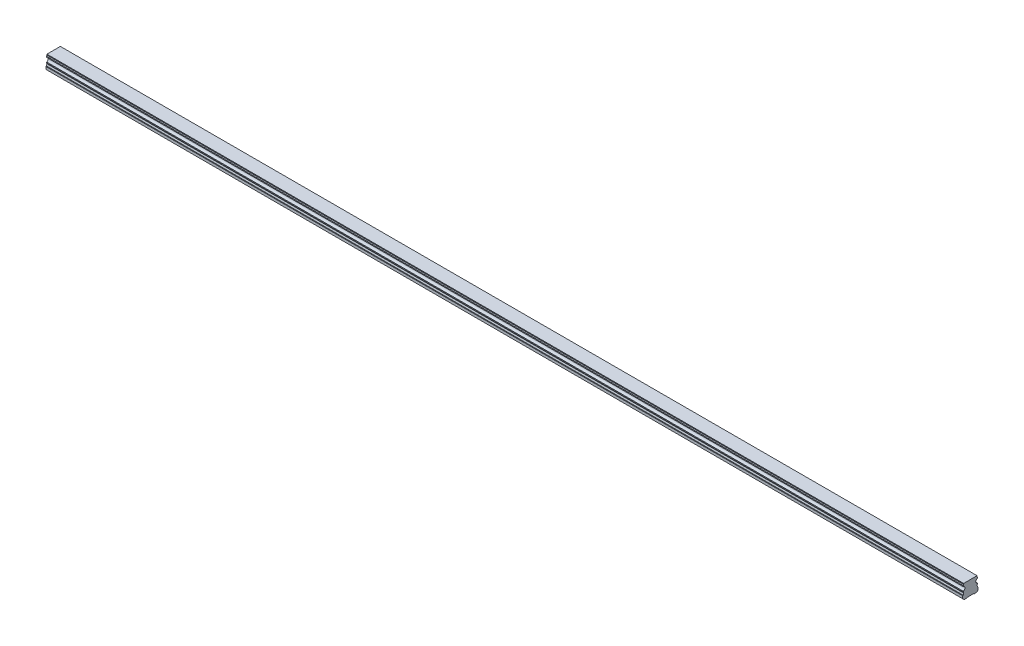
from build123d import *

# Parameters (mm, degrees)
BOSS_EXTRUDE1_DEPTH        = 900
SKETCH3_R                  = 2.5
SKETCH3_R_2                = 2.1
CUT_EXTRUDE3_DEPTH         = 7
SKETCH3_2_R                = 2.1
CUT_EXTRUDE4_DEPTH         = 9.5
CHAMFER1_SIZE              = 0.4
LPATTERN2_COUNT            = 15
LPATTERN2_PITCH            = 60
CHAMFER1_OF_LPATTERN2_SIZE = 0.4


with BuildPart() as part:
    # Sketch1 → Boss-Extrude1 (new body)
    with BuildSketch(Plane(origin=(0, 0, 0), x_dir=(0, 0, -1), z_dir=(1, 0, 0))):
        with BuildLine():
            Line((6.59, 14), (-6.59, 14))
            Line((-6.59, 14), (-6.59, 13.15))
            Line((-6.59, 13.15), (-6.96, 12.356532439))
            Line((-6.96, 12.356532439), (-6.96, 11.435174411))
            ThreePointArc((-6.96, 11.435174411), (-5.25, 9.5), (-6.96, 7.564825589))
            Line((-6.96, 7.564825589), (-6.96, 6.643467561))
            Line((-6.96, 6.643467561), (-6.59, 5.85))
            Line((-6.59, 5.85), (-7.032116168, 4.2))
            Line((-7.032116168, 4.2), (-7.5, 3.929867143))
            Line((-7.5, 3.929867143), (-7.5, 1.4))
            Line((-7.5, 1.4), (-6.1, 0))
            Line((-6.1, 0), (-3.65, 0))
            Line((-3.65, 0), (-3.25, 0.4))
            Line((-3.25, 0.4), (3.25, 0.4))
            Line((3.25, 0.4), (3.65, 0))
            Line((3.65, 0), (6.1, 0))
            Line((6.1, 0), (7.5, 1.4))
            Line((7.5, 1.4), (7.5, 3.929867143))
            Line((7.5, 3.929867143), (7.032116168, 4.2))
            Line((7.032116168, 4.2), (6.59, 5.85))
            Line((6.59, 5.85), (6.96, 6.643467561))
            Line((6.96, 6.643467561), (6.96, 7.564825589))
            ThreePointArc((6.96, 7.564825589), (5.25, 9.5), (6.96, 11.435174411))
            Line((6.96, 11.435174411), (6.96, 12.356532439))
            Line((6.96, 12.356532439), (6.59, 13.15))
            Line((6.59, 13.15), (6.59, 14))
        make_face()
    extrude(amount=BOSS_EXTRUDE1_DEPTH)

    # Sketch3 → Cut-Extrude3 (cut)
    with BuildSketch(Plane.XZ):
        with Locations(Location((30, 0, 0), (0, 0, 270))):
            Circle(SKETCH3_R)
        with Locations(Location((30, 0, 0), (0, 0, 270))):
            Circle(SKETCH3_R_2, mode=Mode.SUBTRACT)
    cut_extrude3 = extrude(amount=-CUT_EXTRUDE3_DEPTH, mode=Mode.SUBTRACT)

    # Sketch3_2 → Cut-Extrude4 (cut)
    with BuildSketch(Plane.XZ):
        with Locations(Location((30, 0, 0), (0, 0, 270))):
            Circle(SKETCH3_2_R)
    cut_extrude4 = extrude(amount=-CUT_EXTRUDE4_DEPTH, mode=Mode.SUBTRACT)

    # Cut-Extrude5 cone 1 section (on through the dimple's axis) → Cut-Extrude5 (revolve, cut)
    with BuildSketch(Plane(origin=(30, 9.5, 0), x_dir=(0, 0, -1), z_dir=(1, 0, 0))):
        Polygon((0, 0), (2.1, 0), (0, 1.212435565), align=None)
    revolve(axis=Axis((30, 9.5, 0), (0, 1, 0)), mode=Mode.SUBTRACT)

    # Chamfer1
    chamfer1_edges = [part.edges().sort_by_distance(p)[0] for p in [
        (30, 0.4, 2.5),
    ]]
    chamfer(chamfer1_edges, length=CHAMFER1_SIZE)

    # LPattern2: Cut-Extrude3, Cut-Extrude4 ×15
    with Locations(*[(i * LPATTERN2_PITCH, 0, 0) for i in range(1, LPATTERN2_COUNT)]):
        add(cut_extrude3, mode=Mode.SUBTRACT)
        add(cut_extrude4, mode=Mode.SUBTRACT)

    # Chamfer1 of LPattern2
    chamfer1_of_lpattern2_edges = [part.edges().sort_by_distance(p)[0] for p in [
        (90, 0.4, 2.5),
        (150, 0.4, 2.5),
        (210, 0.4, 2.5),
        (270, 0.4, 2.5),
        (330, 0.4, 2.5),
        (390, 0.4, 2.5),
        (450, 0.4, 2.5),
        (510, 0.4, 2.5),
        (570, 0.4, 2.5),
        (630, 0.4, 2.5),
        (690, 0.4, 2.5),
        (750, 0.4, 2.5),
        (810, 0.4, 2.5),
        (870, 0.4, 2.5),
    ]]
    chamfer(chamfer1_of_lpattern2_edges, length=CHAMFER1_OF_LPATTERN2_SIZE)


solid = part.part
